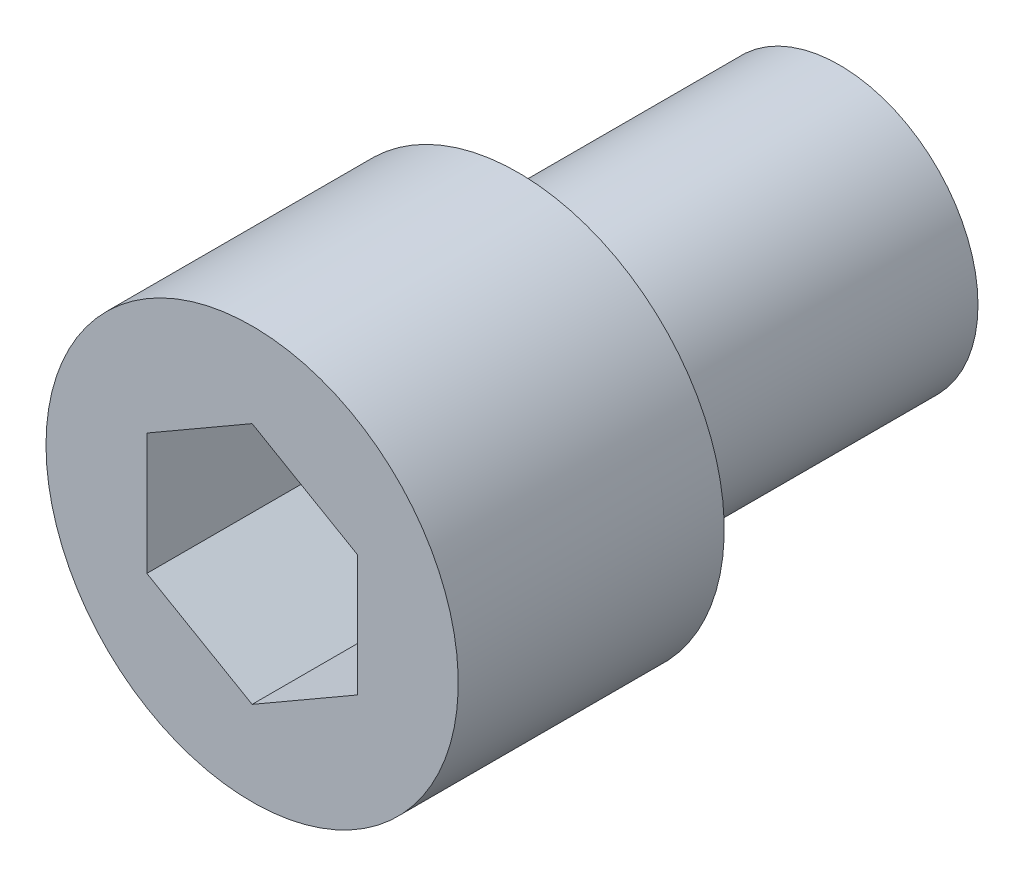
ISO-10303-21;
HEADER;
FILE_DESCRIPTION(('STEP AP214'),'2;1');
FILE_NAME('part.step','',(''),(''),'','','');
FILE_SCHEMA(('AUTOMOTIVE_DESIGN { 1 0 10303 214 1 1 1 1 }'));
ENDSEC;
DATA;
#1=APPLICATION_CONTEXT('core data for automotive mechanical design processes');
#2=APPLICATION_PROTOCOL_DEFINITION('international standard','automotive_design',2000,#1);
#3=PRODUCT_CONTEXT('',#1,'mechanical');
#4=PRODUCT('Part','Part','',(#3));
#5=PRODUCT_RELATED_PRODUCT_CATEGORY('part','',(#4));
#6=PRODUCT_DEFINITION_FORMATION('','',#4);
#7=PRODUCT_DEFINITION_CONTEXT('part definition',#1,'design');
#8=PRODUCT_DEFINITION('design','',#6,#7);
#9=PRODUCT_DEFINITION_SHAPE('','',#8);
#10=(LENGTH_UNIT() NAMED_UNIT(*) SI_UNIT(.MILLI.,.METRE.));
#11=(NAMED_UNIT(*) PLANE_ANGLE_UNIT() SI_UNIT($,.RADIAN.));
#12=(NAMED_UNIT(*) SI_UNIT($,.STERADIAN.) SOLID_ANGLE_UNIT());
#13=UNCERTAINTY_MEASURE_WITH_UNIT(LENGTH_MEASURE(1.E-05),#10,'distance_accuracy_value','');
#14=(GEOMETRIC_REPRESENTATION_CONTEXT(3) GLOBAL_UNCERTAINTY_ASSIGNED_CONTEXT((#13)) GLOBAL_UNIT_ASSIGNED_CONTEXT((#10,
#11,#12)) REPRESENTATION_CONTEXT('',''));
#15=CARTESIAN_POINT('',(0.,0.,0.));
#16=DIRECTION('',(0.,0.,1.));
#17=DIRECTION('',(1.,0.,0.));
#18=AXIS2_PLACEMENT_3D('',#15,#16,#17);
#19=CARTESIAN_POINT('',(0.,0.,7.366));
#20=DIRECTION('',(0.,0.,-1.));
#21=DIRECTION('',(-1.,0.,0.));
#22=AXIS2_PLACEMENT_3D('',#19,#20,#21);
#23=CYLINDRICAL_SURFACE('',#22,3.175);
#24=CARTESIAN_POINT('',(0.,0.,7.366));
#25=DIRECTION('',(0.,0.,1.));
#26=DIRECTION('',(1.,0.,0.));
#27=AXIS2_PLACEMENT_3D('',#24,#25,#26);
#28=CIRCLE('',#27,3.175);
#29=CARTESIAN_POINT('',(3.175,0.,7.366));
#30=VERTEX_POINT('',#29);
#31=EDGE_CURVE('E11',#30,#30,#28,.T.);
#32=ORIENTED_EDGE('',*,*,#31,.F.);
#33=EDGE_LOOP('',(#32));
#34=FACE_BOUND('',#33,.T.);
#35=CARTESIAN_POINT('',(0.,0.,0.));
#36=DIRECTION('',(0.,0.,1.));
#37=DIRECTION('',(1.,0.,0.));
#38=AXIS2_PLACEMENT_3D('',#35,#36,#37);
#39=CIRCLE('',#38,3.175);
#40=CARTESIAN_POINT('',(3.175,0.,0.));
#41=VERTEX_POINT('',#40);
#42=EDGE_CURVE('E39',#41,#41,#39,.T.);
#43=ORIENTED_EDGE('',*,*,#42,.T.);
#44=EDGE_LOOP('',(#43));
#45=FACE_BOUND('',#44,.T.);
#46=ADVANCED_FACE('F31',(#34,#45),#23,.T.);
#47=CARTESIAN_POINT('',(0.,0.,0.));
#48=DIRECTION('',(0.,0.,1.));
#49=DIRECTION('',(1.,0.,0.));
#50=AXIS2_PLACEMENT_3D('',#47,#48,#49);
#51=PLANE('',#50);
#52=CARTESIAN_POINT('',(0.,0.,0.));
#53=DIRECTION('',(0.,0.,-1.));
#54=DIRECTION('',(-1.,0.,0.));
#55=AXIS2_PLACEMENT_3D('',#52,#53,#54);
#56=CIRCLE('',#55,1.5875);
#57=CARTESIAN_POINT('',(-1.5875,0.,0.));
#58=VERTEX_POINT('',#57);
#59=EDGE_CURVE('E200',#58,#58,#56,.T.);
#60=ORIENTED_EDGE('',*,*,#59,.F.);
#61=EDGE_LOOP('',(#60));
#62=FACE_BOUND('',#61,.T.);
#63=ORIENTED_EDGE('',*,*,#42,.F.);
#64=EDGE_LOOP('',(#63));
#65=FACE_BOUND('',#64,.T.);
#66=ADVANCED_FACE('F150',(#62,#65),#51,.F.);
#67=CARTESIAN_POINT('',(0.,0.,7.366));
#68=DIRECTION('',(0.,0.,1.));
#69=DIRECTION('',(1.,0.,0.));
#70=AXIS2_PLACEMENT_3D('',#67,#68,#69);
#71=PLANE('',#70);
#72=CARTESIAN_POINT('',(0.,0.,7.366));
#73=DIRECTION('',(0.,0.,1.));
#74=DIRECTION('',(1.,0.,0.));
#75=AXIS2_PLACEMENT_3D('',#72,#73,#74);
#76=CIRCLE('',#75,4.7244);
#77=CARTESIAN_POINT('',(-4.7244,0.,7.366));
#78=VERTEX_POINT('',#77);
#79=EDGE_CURVE('E134',#78,#78,#76,.T.);
#80=ORIENTED_EDGE('',*,*,#79,.F.);
#81=EDGE_LOOP('',(#80));
#82=FACE_BOUND('',#81,.T.);
#83=ORIENTED_EDGE('',*,*,#31,.T.);
#84=EDGE_LOOP('',(#83));
#85=FACE_BOUND('',#84,.T.);
#86=ADVANCED_FACE('F152',(#82,#85),#71,.F.);
#87=CARTESIAN_POINT('',(0.,0.,13.462));
#88=DIRECTION('',(0.,0.,-1.));
#89=DIRECTION('',(-1.,0.,0.));
#90=AXIS2_PLACEMENT_3D('',#87,#88,#89);
#91=CYLINDRICAL_SURFACE('',#90,4.7244);
#92=CARTESIAN_POINT('',(0.,0.,13.462));
#93=DIRECTION('',(0.,0.,1.));
#94=DIRECTION('',(1.,0.,0.));
#95=AXIS2_PLACEMENT_3D('',#92,#93,#94);
#96=CIRCLE('',#95,4.7244);
#97=CARTESIAN_POINT('',(-4.7244,0.,13.462));
#98=VERTEX_POINT('',#97);
#99=EDGE_CURVE('E143',#98,#98,#96,.T.);
#100=CARTESIAN_POINT('',(-4.7244,0.,13.462));
#101=CARTESIAN_POINT('',(-4.7244,0.,13.3985));
#102=CARTESIAN_POINT('',(-4.7244,0.,13.335));
#103=CARTESIAN_POINT('',(-4.7244,0.,13.208));
#104=CARTESIAN_POINT('',(-4.7244,0.,13.1445));
#105=CARTESIAN_POINT('',(-4.7244,0.,13.0175));
#106=CARTESIAN_POINT('',(-4.7244,0.,12.954));
#107=CARTESIAN_POINT('',(-4.7244,0.,12.827));
#108=CARTESIAN_POINT('',(-4.7244,0.,12.7635));
#109=CARTESIAN_POINT('',(-4.7244,0.,12.6365));
#110=CARTESIAN_POINT('',(-4.7244,0.,12.573));
#111=CARTESIAN_POINT('',(-4.7244,0.,12.446));
#112=CARTESIAN_POINT('',(-4.7244,0.,12.3825));
#113=CARTESIAN_POINT('',(-4.7244,0.,12.2555));
#114=CARTESIAN_POINT('',(-4.7244,0.,12.192));
#115=CARTESIAN_POINT('',(-4.7244,0.,12.065));
#116=CARTESIAN_POINT('',(-4.7244,0.,12.0015));
#117=CARTESIAN_POINT('',(-4.7244,0.,11.8745));
#118=CARTESIAN_POINT('',(-4.7244,0.,11.811));
#119=CARTESIAN_POINT('',(-4.7244,0.,11.684));
#120=CARTESIAN_POINT('',(-4.7244,0.,11.6205));
#121=CARTESIAN_POINT('',(-4.7244,0.,11.4935));
#122=CARTESIAN_POINT('',(-4.7244,0.,11.43));
#123=CARTESIAN_POINT('',(-4.7244,0.,11.303));
#124=CARTESIAN_POINT('',(-4.7244,0.,11.2395));
#125=CARTESIAN_POINT('',(-4.7244,0.,11.1125));
#126=CARTESIAN_POINT('',(-4.7244,0.,11.049));
#127=CARTESIAN_POINT('',(-4.7244,0.,10.922));
#128=CARTESIAN_POINT('',(-4.7244,0.,10.8585));
#129=CARTESIAN_POINT('',(-4.7244,0.,10.7315));
#130=CARTESIAN_POINT('',(-4.7244,0.,10.668));
#131=CARTESIAN_POINT('',(-4.7244,0.,10.541));
#132=CARTESIAN_POINT('',(-4.7244,0.,10.4775));
#133=CARTESIAN_POINT('',(-4.7244,0.,10.3505));
#134=CARTESIAN_POINT('',(-4.7244,0.,10.287));
#135=CARTESIAN_POINT('',(-4.7244,0.,10.16));
#136=CARTESIAN_POINT('',(-4.7244,0.,10.0965));
#137=CARTESIAN_POINT('',(-4.7244,0.,9.9695));
#138=CARTESIAN_POINT('',(-4.7244,0.,9.906));
#139=CARTESIAN_POINT('',(-4.7244,0.,9.779));
#140=CARTESIAN_POINT('',(-4.7244,0.,9.7155));
#141=CARTESIAN_POINT('',(-4.7244,0.,9.5885));
#142=CARTESIAN_POINT('',(-4.7244,0.,9.525));
#143=CARTESIAN_POINT('',(-4.7244,0.,9.398));
#144=CARTESIAN_POINT('',(-4.7244,0.,9.3345));
#145=CARTESIAN_POINT('',(-4.7244,0.,9.2075));
#146=CARTESIAN_POINT('',(-4.7244,0.,9.144));
#147=CARTESIAN_POINT('',(-4.7244,0.,9.017));
#148=CARTESIAN_POINT('',(-4.7244,0.,8.9535));
#149=CARTESIAN_POINT('',(-4.7244,0.,8.8265));
#150=CARTESIAN_POINT('',(-4.7244,0.,8.763));
#151=CARTESIAN_POINT('',(-4.7244,0.,8.636));
#152=CARTESIAN_POINT('',(-4.7244,0.,8.5725));
#153=CARTESIAN_POINT('',(-4.7244,0.,8.4455));
#154=CARTESIAN_POINT('',(-4.7244,0.,8.382));
#155=CARTESIAN_POINT('',(-4.7244,0.,8.255));
#156=CARTESIAN_POINT('',(-4.7244,0.,8.1915));
#157=CARTESIAN_POINT('',(-4.7244,0.,8.0645));
#158=CARTESIAN_POINT('',(-4.7244,0.,8.001));
#159=CARTESIAN_POINT('',(-4.7244,0.,7.874));
#160=CARTESIAN_POINT('',(-4.7244,0.,7.8105));
#161=CARTESIAN_POINT('',(-4.7244,0.,7.6835));
#162=CARTESIAN_POINT('',(-4.7244,0.,7.62));
#163=CARTESIAN_POINT('',(-4.7244,0.,7.493));
#164=CARTESIAN_POINT('',(-4.7244,0.,7.4295));
#165=CARTESIAN_POINT('',(-4.7244,0.,7.366));
#166=B_SPLINE_CURVE_WITH_KNOTS('',3,(#100,#101,#102,#103,#104,#105,#106,#107,#108,#109,#110,
#111,#112,#113,#114,#115,#116,#117,#118,#119,#120,#121,#122,#123,#124,#125,#126,#127,#128,#129,
#130,#131,#132,#133,#134,#135,#136,#137,#138,#139,#140,#141,#142,#143,#144,#145,#146,#147,#148,
#149,#150,#151,#152,#153,#154,#155,#156,#157,#158,#159,#160,#161,#162,#163,#164,#165),
.UNSPECIFIED.,.F.,.F.,(4,2,2,2,2,2,2,2,2,2,2,2,2,2,2,2,2,2,2,2,2,2,2,2,2,2,2,2,2,2,2,2,4),(0.,
0.1905,0.380999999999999,0.571499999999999,0.761999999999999,0.952499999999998,1.143,1.3335,
1.524,1.7145,1.905,2.0955,2.286,2.4765,2.667,2.8575,3.048,3.2385,3.429,3.6195,3.81,4.0005,4.191,
4.3815,4.572,4.7625,4.953,5.1435,5.334,5.5245,5.715,5.9055,6.096),.UNSPECIFIED.);
#167=EDGE_CURVE('BSEAM158',#98,#78,#166,.T.);
#168=ORIENTED_EDGE('',*,*,#99,.F.);
#169=ORIENTED_EDGE('',*,*,#79,.T.);
#170=ORIENTED_EDGE('',*,*,#167,.T.);
#171=ORIENTED_EDGE('',*,*,#167,.F.);
#172=EDGE_LOOP('',(#168,#170,#169,#171));
#173=FACE_BOUND('',#172,.T.);
#174=ADVANCED_FACE('F158',(#173),#91,.T.);
#175=CARTESIAN_POINT('',(0.,0.,13.462));
#176=DIRECTION('',(0.,0.,1.));
#177=DIRECTION('',(1.,0.,0.));
#178=AXIS2_PLACEMENT_3D('',#175,#176,#177);
#179=PLANE('',#178);
#180=DIRECTION('',(-0.866025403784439,-0.5,0.));
#181=VECTOR('',#180,1.);
#182=CARTESIAN_POINT('',(-2.41299774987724,1.39314555,13.462));
#183=LINE('',#182,#181);
#184=CARTESIAN_POINT('',(1.12506124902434E-06,2.7862911,13.462));
#185=VERTEX_POINT('',#184);
#186=CARTESIAN_POINT('',(-2.41299774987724,1.39314555,13.462));
#187=VERTEX_POINT('',#186);
#188=EDGE_CURVE('E46',#185,#187,#183,.T.);
#189=ORIENTED_EDGE('',*,*,#188,.F.);
#190=DIRECTION('',(-0.866025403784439,0.5,0.));
#191=VECTOR('',#190,1.);
#192=CARTESIAN_POINT('',(1.12506124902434E-06,2.7862911,13.462));
#193=LINE('',#192,#191);
#194=CARTESIAN_POINT('',(2.41299999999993,1.39314554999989,13.462));
#195=VERTEX_POINT('',#194);
#196=EDGE_CURVE('E116',#195,#185,#193,.T.);
#197=ORIENTED_EDGE('',*,*,#196,.F.);
#198=DIRECTION('',(0.,1.,0.));
#199=VECTOR('',#198,1.);
#200=CARTESIAN_POINT('',(2.41299999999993,1.39314554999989,13.462));
#201=LINE('',#200,#199);
#202=CARTESIAN_POINT('',(2.41299999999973,-1.39314555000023,13.462));
#203=VERTEX_POINT('',#202);
#204=EDGE_CURVE('E110',#203,#195,#201,.T.);
#205=ORIENTED_EDGE('',*,*,#204,.F.);
#206=DIRECTION('',(0.866025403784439,0.5,0.));
#207=VECTOR('',#206,1.);
#208=CARTESIAN_POINT('',(2.41299999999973,-1.39314555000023,13.462));
#209=LINE('',#208,#207);
#210=CARTESIAN_POINT('',(1.12506124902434E-06,-2.78629110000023,13.462));
#211=VERTEX_POINT('',#210);
#212=EDGE_CURVE('E108',#211,#203,#209,.T.);
#213=ORIENTED_EDGE('',*,*,#212,.F.);
#214=DIRECTION('',(0.866025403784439,-0.5,0.));
#215=VECTOR('',#214,1.);
#216=CARTESIAN_POINT('',(1.12506124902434E-06,-2.78629110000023,13.462));
#217=LINE('',#216,#215);
#218=CARTESIAN_POINT('',(-2.41299774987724,-1.39314555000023,13.462));
#219=VERTEX_POINT('',#218);
#220=EDGE_CURVE('E89',#219,#211,#217,.T.);
#221=ORIENTED_EDGE('',*,*,#220,.F.);
#222=DIRECTION('',(0.,-1.,0.));
#223=VECTOR('',#222,1.);
#224=CARTESIAN_POINT('',(-2.41299774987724,-1.39314555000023,13.462));
#225=LINE('',#224,#223);
#226=EDGE_CURVE('E100',#187,#219,#225,.T.);
#227=ORIENTED_EDGE('',*,*,#226,.F.);
#228=EDGE_LOOP('',(#189,#197,#205,#213,#221,#227));
#229=FACE_BOUND('',#228,.T.);
#230=ORIENTED_EDGE('',*,*,#99,.T.);
#231=EDGE_LOOP('',(#230));
#232=FACE_BOUND('',#231,.T.);
#233=ADVANCED_FACE('F104',(#229,#232),#179,.T.);
#234=CARTESIAN_POINT('',(-2.41299774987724,1.39314555,9.906));
#235=DIRECTION('',(-0.5,0.866025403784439,0.));
#236=DIRECTION('',(-0.866025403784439,-0.5,0.));
#237=AXIS2_PLACEMENT_3D('',#234,#235,#236);
#238=PLANE('',#237);
#239=ORIENTED_EDGE('',*,*,#188,.T.);
#240=DIRECTION('',(0.,0.,1.));
#241=VECTOR('',#240,1.);
#242=CARTESIAN_POINT('',(-2.41299774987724,1.39314555,9.906));
#243=LINE('',#242,#241);
#244=CARTESIAN_POINT('',(-2.41299774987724,1.39314555,9.906));
#245=VERTEX_POINT('',#244);
#246=EDGE_CURVE('E97',#245,#187,#243,.T.);
#247=ORIENTED_EDGE('',*,*,#246,.F.);
#248=DIRECTION('',(-0.866025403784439,-0.5,0.));
#249=VECTOR('',#248,1.);
#250=CARTESIAN_POINT('',(-2.41299774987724,1.39314555,9.906));
#251=LINE('',#250,#249);
#252=CARTESIAN_POINT('',(1.12506124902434E-06,2.7862911,9.906));
#253=VERTEX_POINT('',#252);
#254=EDGE_CURVE('E118',#253,#245,#251,.T.);
#255=ORIENTED_EDGE('',*,*,#254,.F.);
#256=DIRECTION('',(0.,0.,1.));
#257=VECTOR('',#256,1.);
#258=CARTESIAN_POINT('',(1.12506124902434E-06,2.7862911,9.906));
#259=LINE('',#258,#257);
#260=EDGE_CURVE('E53',#253,#185,#259,.T.);
#261=ORIENTED_EDGE('',*,*,#260,.T.);
#262=EDGE_LOOP('',(#239,#247,#255,#261));
#263=FACE_BOUND('',#262,.T.);
#264=ADVANCED_FACE('F168',(#263),#238,.F.);
#265=CARTESIAN_POINT('',(1.12506124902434E-06,2.7862911,9.906));
#266=DIRECTION('',(0.5,0.866025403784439,0.));
#267=DIRECTION('',(-0.866025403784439,0.5,0.));
#268=AXIS2_PLACEMENT_3D('',#265,#266,#267);
#269=PLANE('',#268);
#270=ORIENTED_EDGE('',*,*,#196,.T.);
#271=ORIENTED_EDGE('',*,*,#260,.F.);
#272=DIRECTION('',(-0.866025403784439,0.5,0.));
#273=VECTOR('',#272,1.);
#274=CARTESIAN_POINT('',(1.12506124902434E-06,2.7862911,9.906));
#275=LINE('',#274,#273);
#276=CARTESIAN_POINT('',(2.41299999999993,1.39314554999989,9.906));
#277=VERTEX_POINT('',#276);
#278=EDGE_CURVE('E130',#277,#253,#275,.T.);
#279=ORIENTED_EDGE('',*,*,#278,.F.);
#280=DIRECTION('',(0.,0.,1.));
#281=VECTOR('',#280,1.);
#282=CARTESIAN_POINT('',(2.41299999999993,1.39314554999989,9.906));
#283=LINE('',#282,#281);
#284=EDGE_CURVE('E135',#277,#195,#283,.T.);
#285=ORIENTED_EDGE('',*,*,#284,.T.);
#286=EDGE_LOOP('',(#270,#271,#279,#285));
#287=FACE_BOUND('',#286,.T.);
#288=ADVANCED_FACE('F172',(#287),#269,.F.);
#289=CARTESIAN_POINT('',(2.41299999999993,1.39314554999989,9.906));
#290=DIRECTION('',(1.,0.,0.));
#291=DIRECTION('',(0.,1.,0.));
#292=AXIS2_PLACEMENT_3D('',#289,#290,#291);
#293=PLANE('',#292);
#294=ORIENTED_EDGE('',*,*,#204,.T.);
#295=ORIENTED_EDGE('',*,*,#284,.F.);
#296=DIRECTION('',(0.,1.,0.));
#297=VECTOR('',#296,1.);
#298=CARTESIAN_POINT('',(2.41299999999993,1.39314554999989,9.906));
#299=LINE('',#298,#297);
#300=CARTESIAN_POINT('',(2.41299999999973,-1.39314555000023,9.906));
#301=VERTEX_POINT('',#300);
#302=EDGE_CURVE('E127',#301,#277,#299,.T.);
#303=ORIENTED_EDGE('',*,*,#302,.F.);
#304=DIRECTION('',(0.,0.,1.));
#305=VECTOR('',#304,1.);
#306=CARTESIAN_POINT('',(2.41299999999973,-1.39314555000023,9.906));
#307=LINE('',#306,#305);
#308=EDGE_CURVE('E137',#301,#203,#307,.T.);
#309=ORIENTED_EDGE('',*,*,#308,.T.);
#310=EDGE_LOOP('',(#294,#295,#303,#309));
#311=FACE_BOUND('',#310,.T.);
#312=ADVANCED_FACE('F181',(#311),#293,.F.);
#313=CARTESIAN_POINT('',(2.41299999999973,-1.39314555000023,9.906));
#314=DIRECTION('',(0.5,-0.866025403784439,0.));
#315=DIRECTION('',(0.866025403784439,0.5,0.));
#316=AXIS2_PLACEMENT_3D('',#313,#314,#315);
#317=PLANE('',#316);
#318=ORIENTED_EDGE('',*,*,#212,.T.);
#319=ORIENTED_EDGE('',*,*,#308,.F.);
#320=DIRECTION('',(0.866025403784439,0.5,0.));
#321=VECTOR('',#320,1.);
#322=CARTESIAN_POINT('',(2.41299999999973,-1.39314555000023,9.906));
#323=LINE('',#322,#321);
#324=CARTESIAN_POINT('',(1.12506124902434E-06,-2.78629110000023,9.906));
#325=VERTEX_POINT('',#324);
#326=EDGE_CURVE('E124',#325,#301,#323,.T.);
#327=ORIENTED_EDGE('',*,*,#326,.F.);
#328=DIRECTION('',(0.,0.,1.));
#329=VECTOR('',#328,1.);
#330=CARTESIAN_POINT('',(1.12506124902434E-06,-2.78629110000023,9.906));
#331=LINE('',#330,#329);
#332=EDGE_CURVE('E96',#325,#211,#331,.T.);
#333=ORIENTED_EDGE('',*,*,#332,.T.);
#334=EDGE_LOOP('',(#318,#319,#327,#333));
#335=FACE_BOUND('',#334,.T.);
#336=ADVANCED_FACE('F178',(#335),#317,.F.);
#337=CARTESIAN_POINT('',(1.12506124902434E-06,-2.78629110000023,9.906));
#338=DIRECTION('',(-0.5,-0.866025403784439,0.));
#339=DIRECTION('',(0.866025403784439,-0.5,0.));
#340=AXIS2_PLACEMENT_3D('',#337,#338,#339);
#341=PLANE('',#340);
#342=ORIENTED_EDGE('',*,*,#220,.T.);
#343=ORIENTED_EDGE('',*,*,#332,.F.);
#344=DIRECTION('',(0.866025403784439,-0.5,0.));
#345=VECTOR('',#344,1.);
#346=CARTESIAN_POINT('',(1.12506124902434E-06,-2.78629110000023,9.906));
#347=LINE('',#346,#345);
#348=CARTESIAN_POINT('',(-2.41299774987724,-1.39314555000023,9.906));
#349=VERTEX_POINT('',#348);
#350=EDGE_CURVE('E92',#349,#325,#347,.T.);
#351=ORIENTED_EDGE('',*,*,#350,.F.);
#352=DIRECTION('',(0.,0.,1.));
#353=VECTOR('',#352,1.);
#354=CARTESIAN_POINT('',(-2.41299774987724,-1.39314555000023,9.906));
#355=LINE('',#354,#353);
#356=EDGE_CURVE('E85',#349,#219,#355,.T.);
#357=ORIENTED_EDGE('',*,*,#356,.T.);
#358=EDGE_LOOP('',(#342,#343,#351,#357));
#359=FACE_BOUND('',#358,.T.);
#360=ADVANCED_FACE('F87',(#359),#341,.F.);
#361=CARTESIAN_POINT('',(-2.41299774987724,-1.39314555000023,9.906));
#362=DIRECTION('',(-1.,0.,0.));
#363=DIRECTION('',(0.,0.,1.));
#364=AXIS2_PLACEMENT_3D('',#361,#362,#363);
#365=PLANE('',#364);
#366=ORIENTED_EDGE('',*,*,#226,.T.);
#367=ORIENTED_EDGE('',*,*,#356,.F.);
#368=DIRECTION('',(0.,-1.,0.));
#369=VECTOR('',#368,1.);
#370=CARTESIAN_POINT('',(-2.41299774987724,-1.39314555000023,9.906));
#371=LINE('',#370,#369);
#372=EDGE_CURVE('E121',#245,#349,#371,.T.);
#373=ORIENTED_EDGE('',*,*,#372,.F.);
#374=ORIENTED_EDGE('',*,*,#246,.T.);
#375=EDGE_LOOP('',(#366,#367,#373,#374));
#376=FACE_BOUND('',#375,.T.);
#377=ADVANCED_FACE('F101',(#376),#365,.F.);
#378=CARTESIAN_POINT('',(-2.41299774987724,1.39314555,9.906));
#379=DIRECTION('',(0.,0.,1.));
#380=DIRECTION('',(1.,0.,0.));
#381=AXIS2_PLACEMENT_3D('',#378,#379,#380);
#382=PLANE('',#381);
#383=CARTESIAN_POINT('',(0.,0.,9.906));
#384=DIRECTION('',(0.,0.,1.));
#385=DIRECTION('',(1.,0.,0.));
#386=AXIS2_PLACEMENT_3D('',#383,#384,#385);
#387=CIRCLE('',#386,1.5875);
#388=CARTESIAN_POINT('',(1.5875,0.,9.906));
#389=VERTEX_POINT('',#388);
#390=EDGE_CURVE('E34',#389,#389,#387,.T.);
#391=ORIENTED_EDGE('',*,*,#390,.F.);
#392=EDGE_LOOP('',(#391));
#393=FACE_BOUND('',#392,.T.);
#394=ORIENTED_EDGE('',*,*,#254,.T.);
#395=ORIENTED_EDGE('',*,*,#372,.T.);
#396=ORIENTED_EDGE('',*,*,#350,.T.);
#397=ORIENTED_EDGE('',*,*,#326,.T.);
#398=ORIENTED_EDGE('',*,*,#302,.T.);
#399=ORIENTED_EDGE('',*,*,#278,.T.);
#400=EDGE_LOOP('',(#394,#395,#396,#397,#398,#399));
#401=FACE_BOUND('',#400,.T.);
#402=ADVANCED_FACE('F175',(#393,#401),#382,.T.);
#403=CARTESIAN_POINT('',(0.,0.,13.462));
#404=DIRECTION('',(0.,0.,-1.));
#405=DIRECTION('',(-1.,0.,0.));
#406=AXIS2_PLACEMENT_3D('',#403,#404,#405);
#407=CYLINDRICAL_SURFACE('',#406,1.5875);
#408=ORIENTED_EDGE('',*,*,#390,.T.);
#409=EDGE_LOOP('',(#408));
#410=FACE_BOUND('',#409,.T.);
#411=ORIENTED_EDGE('',*,*,#59,.T.);
#412=EDGE_LOOP('',(#411));
#413=FACE_BOUND('',#412,.T.);
#414=ADVANCED_FACE('F190',(#410,#413),#407,.F.);
#415=CLOSED_SHELL('',(#46,#66,#86,#174,#233,#264,#288,#312,#336,#360,#377,#402,#414));
#416=MANIFOLD_SOLID_BREP('B2',#415);
#417=ADVANCED_BREP_SHAPE_REPRESENTATION('',(#18,#416),#14);
#418=SHAPE_DEFINITION_REPRESENTATION(#9,#417);
ENDSEC;
END-ISO-10303-21;
